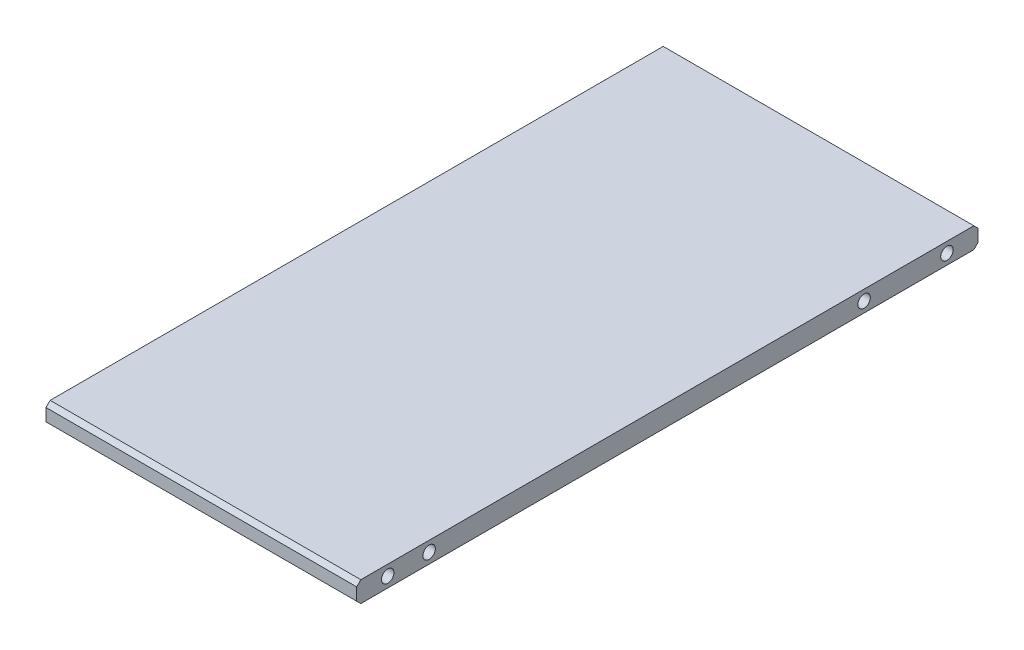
ISO-10303-21;
HEADER;
FILE_DESCRIPTION(('STEP AP214'),'2;1');
FILE_NAME('part.step','',(''),(''),'','','');
FILE_SCHEMA(('AUTOMOTIVE_DESIGN { 1 0 10303 214 1 1 1 1 }'));
ENDSEC;
DATA;
#1=APPLICATION_CONTEXT('core data for automotive mechanical design processes');
#2=APPLICATION_PROTOCOL_DEFINITION('international standard','automotive_design',2000,#1);
#3=PRODUCT_CONTEXT('',#1,'mechanical');
#4=PRODUCT('Part','Part','',(#3));
#5=PRODUCT_RELATED_PRODUCT_CATEGORY('part','',(#4));
#6=PRODUCT_DEFINITION_FORMATION('','',#4);
#7=PRODUCT_DEFINITION_CONTEXT('part definition',#1,'design');
#8=PRODUCT_DEFINITION('design','',#6,#7);
#9=PRODUCT_DEFINITION_SHAPE('','',#8);
#10=(LENGTH_UNIT() NAMED_UNIT(*) SI_UNIT(.MILLI.,.METRE.));
#11=(NAMED_UNIT(*) PLANE_ANGLE_UNIT() SI_UNIT($,.RADIAN.));
#12=(NAMED_UNIT(*) SI_UNIT($,.STERADIAN.) SOLID_ANGLE_UNIT());
#13=UNCERTAINTY_MEASURE_WITH_UNIT(LENGTH_MEASURE(1.E-05),#10,'distance_accuracy_value','');
#14=(GEOMETRIC_REPRESENTATION_CONTEXT(3) GLOBAL_UNCERTAINTY_ASSIGNED_CONTEXT((#13)) GLOBAL_UNIT_ASSIGNED_CONTEXT((#10,
#11,#12)) REPRESENTATION_CONTEXT('',''));
#15=CARTESIAN_POINT('',(0.,0.,0.));
#16=DIRECTION('',(0.,0.,1.));
#17=DIRECTION('',(1.,0.,0.));
#18=AXIS2_PLACEMENT_3D('',#15,#16,#17);
#19=CARTESIAN_POINT('',(-150.,-10.5,0.));
#20=DIRECTION('',(0.,0.,1.));
#21=DIRECTION('',(1.,0.,0.));
#22=AXIS2_PLACEMENT_3D('',#19,#20,#21);
#23=PLANE('',#22);
#24=DIRECTION('',(0.,1.,0.));
#25=VECTOR('',#24,1.);
#26=CARTESIAN_POINT('',(-150.,-10.5,0.));
#27=LINE('',#26,#25);
#28=CARTESIAN_POINT('',(-150.,-8.50000000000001,0.));
#29=VERTEX_POINT('',#28);
#30=CARTESIAN_POINT('',(-150.,-2.50000000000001,0.));
#31=VERTEX_POINT('',#30);
#32=EDGE_CURVE('E102',#29,#31,#27,.T.);
#33=ORIENTED_EDGE('',*,*,#32,.F.);
#34=DIRECTION('',(1.,0.,0.));
#35=VECTOR('',#34,1.);
#36=CARTESIAN_POINT('',(0.,-8.50000000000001,0.));
#37=LINE('',#36,#35);
#38=CARTESIAN_POINT('',(0.,-8.50000000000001,0.));
#39=VERTEX_POINT('',#38);
#40=EDGE_CURVE('E114',#29,#39,#37,.T.);
#41=ORIENTED_EDGE('',*,*,#40,.T.);
#42=DIRECTION('',(0.,1.,0.));
#43=VECTOR('',#42,1.);
#44=CARTESIAN_POINT('',(0.,-10.5,0.));
#45=LINE('',#44,#43);
#46=CARTESIAN_POINT('',(0.,-2.50000000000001,0.));
#47=VERTEX_POINT('',#46);
#48=EDGE_CURVE('E170',#39,#47,#45,.T.);
#49=ORIENTED_EDGE('',*,*,#48,.T.);
#50=DIRECTION('',(-1.,0.,0.));
#51=VECTOR('',#50,1.);
#52=CARTESIAN_POINT('',(-150.,-2.50000000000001,0.));
#53=LINE('',#52,#51);
#54=EDGE_CURVE('E117',#47,#31,#53,.T.);
#55=ORIENTED_EDGE('',*,*,#54,.T.);
#56=EDGE_LOOP('',(#33,#41,#49,#55));
#57=FACE_BOUND('',#56,.T.);
#58=ADVANCED_FACE('F32',(#57),#23,.T.);
#59=CARTESIAN_POINT('',(-150.,-10.5,-300.));
#60=DIRECTION('',(-1.,0.,0.));
#61=DIRECTION('',(0.,0.,1.));
#62=AXIS2_PLACEMENT_3D('',#59,#60,#61);
#63=PLANE('',#62);
#64=CARTESIAN_POINT('',(-150.,-5.50000000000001,-35.));
#65=DIRECTION('',(1.,0.,0.));
#66=DIRECTION('',(0.,0.,-1.));
#67=AXIS2_PLACEMENT_3D('',#64,#65,#66);
#68=CIRCLE('',#67,3.00000000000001);
#69=CARTESIAN_POINT('',(-150.,-5.50000000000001,-38.));
#70=VERTEX_POINT('',#69);
#71=EDGE_CURVE('E187',#70,#70,#68,.T.);
#72=ORIENTED_EDGE('',*,*,#71,.T.);
#73=EDGE_LOOP('',(#72));
#74=FACE_BOUND('',#73,.T.);
#75=CARTESIAN_POINT('',(-150.,-5.50000000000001,-285.));
#76=DIRECTION('',(1.,0.,0.));
#77=DIRECTION('',(0.,0.,-1.));
#78=AXIS2_PLACEMENT_3D('',#75,#76,#77);
#79=CIRCLE('',#78,2.99999999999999);
#80=CARTESIAN_POINT('',(-150.,-5.50000000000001,-288.));
#81=VERTEX_POINT('',#80);
#82=EDGE_CURVE('E181',#81,#81,#79,.T.);
#83=ORIENTED_EDGE('',*,*,#82,.T.);
#84=EDGE_LOOP('',(#83));
#85=FACE_BOUND('',#84,.T.);
#86=CARTESIAN_POINT('',(-150.,-5.50000000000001,-245.));
#87=DIRECTION('',(1.,0.,0.));
#88=DIRECTION('',(0.,0.,-1.));
#89=AXIS2_PLACEMENT_3D('',#86,#87,#88);
#90=CIRCLE('',#89,2.99999999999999);
#91=CARTESIAN_POINT('',(-150.,-5.50000000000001,-248.));
#92=VERTEX_POINT('',#91);
#93=EDGE_CURVE('E176',#92,#92,#90,.T.);
#94=ORIENTED_EDGE('',*,*,#93,.T.);
#95=EDGE_LOOP('',(#94));
#96=FACE_BOUND('',#95,.T.);
#97=CARTESIAN_POINT('',(-150.,-5.50000000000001,-15.));
#98=DIRECTION('',(1.,0.,0.));
#99=DIRECTION('',(0.,0.,-1.));
#100=AXIS2_PLACEMENT_3D('',#97,#98,#99);
#101=CIRCLE('',#100,3.00000000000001);
#102=CARTESIAN_POINT('',(-150.,-5.50000000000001,-18.));
#103=VERTEX_POINT('',#102);
#104=EDGE_CURVE('E158',#103,#103,#101,.T.);
#105=ORIENTED_EDGE('',*,*,#104,.T.);
#106=EDGE_LOOP('',(#105));
#107=FACE_BOUND('',#106,.T.);
#108=DIRECTION('',(0.,0.,1.));
#109=VECTOR('',#108,1.);
#110=CARTESIAN_POINT('',(-150.,-10.5,-300.));
#111=LINE('',#110,#109);
#112=CARTESIAN_POINT('',(-150.,-10.5,-298.));
#113=VERTEX_POINT('',#112);
#114=CARTESIAN_POINT('',(-150.,-10.5,-2.));
#115=VERTEX_POINT('',#114);
#116=EDGE_CURVE('E105',#113,#115,#111,.T.);
#117=ORIENTED_EDGE('',*,*,#116,.T.);
#118=DIRECTION('',(0.,0.707106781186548,0.707106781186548));
#119=VECTOR('',#118,1.);
#120=CARTESIAN_POINT('',(-150.,-159.5,-151.));
#121=LINE('',#120,#119);
#122=EDGE_CURVE('E99',#115,#29,#121,.T.);
#123=ORIENTED_EDGE('',*,*,#122,.T.);
#124=ORIENTED_EDGE('',*,*,#32,.T.);
#125=DIRECTION('',(0.,-0.707106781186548,0.707106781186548));
#126=VECTOR('',#125,1.);
#127=CARTESIAN_POINT('',(-150.,143.5,-146.));
#128=LINE('',#127,#126);
#129=CARTESIAN_POINT('',(-150.,-0.500000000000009,-2.));
#130=VERTEX_POINT('',#129);
#131=EDGE_CURVE('E137',#31,#130,#128,.F.);
#132=ORIENTED_EDGE('',*,*,#131,.T.);
#133=DIRECTION('',(0.,0.,1.));
#134=VECTOR('',#133,1.);
#135=CARTESIAN_POINT('',(-150.,-0.500000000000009,-300.));
#136=LINE('',#135,#134);
#137=CARTESIAN_POINT('',(-150.,-0.500000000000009,-298.));
#138=VERTEX_POINT('',#137);
#139=EDGE_CURVE('E152',#138,#130,#136,.T.);
#140=ORIENTED_EDGE('',*,*,#139,.F.);
#141=DIRECTION('',(0.,0.707106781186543,0.707106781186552));
#142=VECTOR('',#141,1.);
#143=CARTESIAN_POINT('',(-150.,-6.49999999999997,-304.));
#144=LINE('',#143,#142);
#145=CARTESIAN_POINT('',(-150.,-2.50000000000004,-300.));
#146=VERTEX_POINT('',#145);
#147=EDGE_CURVE('E47',#138,#146,#144,.F.);
#148=ORIENTED_EDGE('',*,*,#147,.T.);
#149=DIRECTION('',(0.,1.,0.));
#150=VECTOR('',#149,1.);
#151=CARTESIAN_POINT('',(-150.,-10.5,-300.));
#152=LINE('',#151,#150);
#153=CARTESIAN_POINT('',(-150.,-8.50000000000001,-300.));
#154=VERTEX_POINT('',#153);
#155=EDGE_CURVE('E118',#154,#146,#152,.T.);
#156=ORIENTED_EDGE('',*,*,#155,.F.);
#157=DIRECTION('',(0.,-0.707106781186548,0.707106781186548));
#158=VECTOR('',#157,1.);
#159=CARTESIAN_POINT('',(-150.,-9.50000000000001,-299.));
#160=LINE('',#159,#158);
#161=EDGE_CURVE('E55',#154,#113,#160,.T.);
#162=ORIENTED_EDGE('',*,*,#161,.T.);
#163=EDGE_LOOP('',(#117,#123,#124,#132,#140,#148,#156,#162));
#164=FACE_BOUND('',#163,.T.);
#165=ADVANCED_FACE('F101',(#74,#85,#96,#107,#164),#63,.T.);
#166=CARTESIAN_POINT('',(0.,-10.5,-300.));
#167=DIRECTION('',(0.,0.,-1.));
#168=DIRECTION('',(-1.,0.,0.));
#169=AXIS2_PLACEMENT_3D('',#166,#167,#168);
#170=PLANE('',#169);
#171=DIRECTION('',(0.,1.,0.));
#172=VECTOR('',#171,1.);
#173=CARTESIAN_POINT('',(0.,-10.5,-300.));
#174=LINE('',#173,#172);
#175=CARTESIAN_POINT('',(0.,-8.50000000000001,-300.));
#176=VERTEX_POINT('',#175);
#177=CARTESIAN_POINT('',(0.,-2.50000000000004,-300.));
#178=VERTEX_POINT('',#177);
#179=EDGE_CURVE('E169',#176,#178,#174,.T.);
#180=ORIENTED_EDGE('',*,*,#179,.F.);
#181=DIRECTION('',(-1.,0.,0.));
#182=VECTOR('',#181,1.);
#183=CARTESIAN_POINT('',(-150.,-8.50000000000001,-300.));
#184=LINE('',#183,#182);
#185=EDGE_CURVE('E142',#176,#154,#184,.T.);
#186=ORIENTED_EDGE('',*,*,#185,.T.);
#187=ORIENTED_EDGE('',*,*,#155,.T.);
#188=DIRECTION('',(1.,0.,0.));
#189=VECTOR('',#188,1.);
#190=CARTESIAN_POINT('',(0.,-2.50000000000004,-300.));
#191=LINE('',#190,#189);
#192=EDGE_CURVE('E109',#146,#178,#191,.T.);
#193=ORIENTED_EDGE('',*,*,#192,.T.);
#194=EDGE_LOOP('',(#180,#186,#187,#193));
#195=FACE_BOUND('',#194,.T.);
#196=ADVANCED_FACE('F209',(#195),#170,.T.);
#197=CARTESIAN_POINT('',(0.,-10.5,0.));
#198=DIRECTION('',(1.,0.,0.));
#199=DIRECTION('',(0.,0.,-1.));
#200=AXIS2_PLACEMENT_3D('',#197,#198,#199);
#201=PLANE('',#200);
#202=CARTESIAN_POINT('',(0.,-5.50000000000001,-35.));
#203=DIRECTION('',(1.,0.,0.));
#204=DIRECTION('',(0.,0.,-1.));
#205=AXIS2_PLACEMENT_3D('',#202,#203,#204);
#206=CIRCLE('',#205,3.00000000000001);
#207=CARTESIAN_POINT('',(0.,-5.50000000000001,-38.));
#208=VERTEX_POINT('',#207);
#209=EDGE_CURVE('E184',#208,#208,#206,.T.);
#210=ORIENTED_EDGE('',*,*,#209,.F.);
#211=EDGE_LOOP('',(#210));
#212=FACE_BOUND('',#211,.T.);
#213=CARTESIAN_POINT('',(0.,-5.50000000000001,-285.));
#214=DIRECTION('',(1.,0.,0.));
#215=DIRECTION('',(0.,0.,-1.));
#216=AXIS2_PLACEMENT_3D('',#213,#214,#215);
#217=CIRCLE('',#216,2.99999999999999);
#218=CARTESIAN_POINT('',(0.,-5.50000000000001,-288.));
#219=VERTEX_POINT('',#218);
#220=EDGE_CURVE('E190',#219,#219,#217,.T.);
#221=ORIENTED_EDGE('',*,*,#220,.F.);
#222=EDGE_LOOP('',(#221));
#223=FACE_BOUND('',#222,.T.);
#224=CARTESIAN_POINT('',(0.,-5.50000000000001,-245.));
#225=DIRECTION('',(1.,0.,0.));
#226=DIRECTION('',(0.,0.,-1.));
#227=AXIS2_PLACEMENT_3D('',#224,#225,#226);
#228=CIRCLE('',#227,2.99999999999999);
#229=CARTESIAN_POINT('',(0.,-5.50000000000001,-248.));
#230=VERTEX_POINT('',#229);
#231=EDGE_CURVE('E178',#230,#230,#228,.T.);
#232=ORIENTED_EDGE('',*,*,#231,.F.);
#233=EDGE_LOOP('',(#232));
#234=FACE_BOUND('',#233,.T.);
#235=CARTESIAN_POINT('',(0.,-5.50000000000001,-15.));
#236=DIRECTION('',(1.,0.,0.));
#237=DIRECTION('',(0.,0.,-1.));
#238=AXIS2_PLACEMENT_3D('',#235,#236,#237);
#239=CIRCLE('',#238,3.00000000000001);
#240=CARTESIAN_POINT('',(0.,-5.50000000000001,-18.));
#241=VERTEX_POINT('',#240);
#242=EDGE_CURVE('E163',#241,#241,#239,.T.);
#243=ORIENTED_EDGE('',*,*,#242,.F.);
#244=EDGE_LOOP('',(#243));
#245=FACE_BOUND('',#244,.T.);
#246=ORIENTED_EDGE('',*,*,#48,.F.);
#247=DIRECTION('',(0.,-0.707106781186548,-0.707106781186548));
#248=VECTOR('',#247,1.);
#249=CARTESIAN_POINT('',(0.,-9.50000000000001,-1.));
#250=LINE('',#249,#248);
#251=CARTESIAN_POINT('',(0.,-10.5,-2.));
#252=VERTEX_POINT('',#251);
#253=EDGE_CURVE('E121',#39,#252,#250,.T.);
#254=ORIENTED_EDGE('',*,*,#253,.T.);
#255=DIRECTION('',(0.,0.,-1.));
#256=VECTOR('',#255,1.);
#257=CARTESIAN_POINT('',(0.,-10.5,0.));
#258=LINE('',#257,#256);
#259=CARTESIAN_POINT('',(0.,-10.5,-298.));
#260=VERTEX_POINT('',#259);
#261=EDGE_CURVE('E160',#252,#260,#258,.T.);
#262=ORIENTED_EDGE('',*,*,#261,.T.);
#263=DIRECTION('',(0.,0.707106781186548,-0.707106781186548));
#264=VECTOR('',#263,1.);
#265=CARTESIAN_POINT('',(0.,-159.5,-149.));
#266=LINE('',#265,#264);
#267=EDGE_CURVE('E130',#260,#176,#266,.T.);
#268=ORIENTED_EDGE('',*,*,#267,.T.);
#269=ORIENTED_EDGE('',*,*,#179,.T.);
#270=DIRECTION('',(0.,-0.707106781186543,-0.707106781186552));
#271=VECTOR('',#270,1.);
#272=CARTESIAN_POINT('',(0.,143.5,-153.999999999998));
#273=LINE('',#272,#271);
#274=CARTESIAN_POINT('',(0.,-0.500000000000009,-298.));
#275=VERTEX_POINT('',#274);
#276=EDGE_CURVE('E124',#178,#275,#273,.F.);
#277=ORIENTED_EDGE('',*,*,#276,.T.);
#278=DIRECTION('',(0.,0.,-1.));
#279=VECTOR('',#278,1.);
#280=CARTESIAN_POINT('',(0.,-0.500000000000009,0.));
#281=LINE('',#280,#279);
#282=CARTESIAN_POINT('',(0.,-0.500000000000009,-2.));
#283=VERTEX_POINT('',#282);
#284=EDGE_CURVE('E150',#283,#275,#281,.T.);
#285=ORIENTED_EDGE('',*,*,#284,.F.);
#286=DIRECTION('',(0.,0.707106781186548,-0.707106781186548));
#287=VECTOR('',#286,1.);
#288=CARTESIAN_POINT('',(0.,-6.50000000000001,4.));
#289=LINE('',#288,#287);
#290=EDGE_CURVE('E122',#283,#47,#289,.F.);
#291=ORIENTED_EDGE('',*,*,#290,.T.);
#292=EDGE_LOOP('',(#246,#254,#262,#268,#269,#277,#285,#291));
#293=FACE_BOUND('',#292,.T.);
#294=ADVANCED_FACE('F155',(#212,#223,#234,#245,#293),#201,.T.);
#295=CARTESIAN_POINT('',(0.,-10.5,0.));
#296=DIRECTION('',(0.,1.,0.));
#297=DIRECTION('',(0.,0.,1.));
#298=AXIS2_PLACEMENT_3D('',#295,#296,#297);
#299=PLANE('',#298);
#300=ORIENTED_EDGE('',*,*,#261,.F.);
#301=DIRECTION('',(-1.,0.,0.));
#302=VECTOR('',#301,1.);
#303=CARTESIAN_POINT('',(-150.,-10.5,-2.));
#304=LINE('',#303,#302);
#305=EDGE_CURVE('E135',#252,#115,#304,.T.);
#306=ORIENTED_EDGE('',*,*,#305,.T.);
#307=ORIENTED_EDGE('',*,*,#116,.F.);
#308=DIRECTION('',(1.,0.,0.));
#309=VECTOR('',#308,1.);
#310=CARTESIAN_POINT('',(0.,-10.5,-298.));
#311=LINE('',#310,#309);
#312=EDGE_CURVE('E133',#113,#260,#311,.T.);
#313=ORIENTED_EDGE('',*,*,#312,.T.);
#314=EDGE_LOOP('',(#300,#306,#307,#313));
#315=FACE_BOUND('',#314,.T.);
#316=ADVANCED_FACE('F208',(#315),#299,.F.);
#317=CARTESIAN_POINT('',(0.,-0.500000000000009,0.));
#318=DIRECTION('',(0.,1.,0.));
#319=DIRECTION('',(0.,0.,1.));
#320=AXIS2_PLACEMENT_3D('',#317,#318,#319);
#321=PLANE('',#320);
#322=ORIENTED_EDGE('',*,*,#284,.T.);
#323=DIRECTION('',(-1.,0.,0.));
#324=VECTOR('',#323,1.);
#325=CARTESIAN_POINT('',(0.,-0.500000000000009,-298.));
#326=LINE('',#325,#324);
#327=EDGE_CURVE('E11',#275,#138,#326,.T.);
#328=ORIENTED_EDGE('',*,*,#327,.T.);
#329=ORIENTED_EDGE('',*,*,#139,.T.);
#330=DIRECTION('',(1.,0.,0.));
#331=VECTOR('',#330,1.);
#332=CARTESIAN_POINT('',(0.,-0.500000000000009,-2.));
#333=LINE('',#332,#331);
#334=EDGE_CURVE('E40',#130,#283,#333,.T.);
#335=ORIENTED_EDGE('',*,*,#334,.T.);
#336=EDGE_LOOP('',(#322,#328,#329,#335));
#337=FACE_BOUND('',#336,.T.);
#338=ADVANCED_FACE('F149',(#337),#321,.T.);
#339=CARTESIAN_POINT('',(-150.,-8.50000000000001,0.));
#340=DIRECTION('',(0.,-0.707106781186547,0.707106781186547));
#341=DIRECTION('',(-1.,0.,0.));
#342=AXIS2_PLACEMENT_3D('',#339,#340,#341);
#343=PLANE('',#342);
#344=ORIENTED_EDGE('',*,*,#122,.F.);
#345=ORIENTED_EDGE('',*,*,#305,.F.);
#346=ORIENTED_EDGE('',*,*,#253,.F.);
#347=ORIENTED_EDGE('',*,*,#40,.F.);
#348=EDGE_LOOP('',(#344,#345,#346,#347));
#349=FACE_BOUND('',#348,.T.);
#350=ADVANCED_FACE('F120',(#349),#343,.T.);
#351=CARTESIAN_POINT('',(0.,-8.50000000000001,-300.));
#352=DIRECTION('',(0.,-0.707106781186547,-0.707106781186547));
#353=DIRECTION('',(1.,0.,0.));
#354=AXIS2_PLACEMENT_3D('',#351,#352,#353);
#355=PLANE('',#354);
#356=ORIENTED_EDGE('',*,*,#267,.F.);
#357=ORIENTED_EDGE('',*,*,#312,.F.);
#358=ORIENTED_EDGE('',*,*,#161,.F.);
#359=ORIENTED_EDGE('',*,*,#185,.F.);
#360=EDGE_LOOP('',(#356,#357,#358,#359));
#361=FACE_BOUND('',#360,.T.);
#362=ADVANCED_FACE('F240',(#361),#355,.T.);
#363=CARTESIAN_POINT('',(0.,-0.500000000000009,-298.));
#364=DIRECTION('',(0.,-0.707106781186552,0.707106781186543));
#365=DIRECTION('',(-1.,0.,0.));
#366=AXIS2_PLACEMENT_3D('',#363,#364,#365);
#367=PLANE('',#366);
#368=ORIENTED_EDGE('',*,*,#276,.F.);
#369=ORIENTED_EDGE('',*,*,#192,.F.);
#370=ORIENTED_EDGE('',*,*,#147,.F.);
#371=ORIENTED_EDGE('',*,*,#327,.F.);
#372=EDGE_LOOP('',(#368,#369,#370,#371));
#373=FACE_BOUND('',#372,.T.);
#374=ADVANCED_FACE('F226',(#373),#367,.F.);
#375=CARTESIAN_POINT('',(0.,-0.500000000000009,-2.));
#376=DIRECTION('',(0.,-0.707106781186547,-0.707106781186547));
#377=DIRECTION('',(1.,0.,0.));
#378=AXIS2_PLACEMENT_3D('',#375,#376,#377);
#379=PLANE('',#378);
#380=ORIENTED_EDGE('',*,*,#131,.F.);
#381=ORIENTED_EDGE('',*,*,#54,.F.);
#382=ORIENTED_EDGE('',*,*,#290,.F.);
#383=ORIENTED_EDGE('',*,*,#334,.F.);
#384=EDGE_LOOP('',(#380,#381,#382,#383));
#385=FACE_BOUND('',#384,.T.);
#386=ADVANCED_FACE('F34',(#385),#379,.F.);
#387=CARTESIAN_POINT('',(-150.,-5.50000000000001,-15.));
#388=DIRECTION('',(1.,0.,0.));
#389=DIRECTION('',(0.,0.,-1.));
#390=AXIS2_PLACEMENT_3D('',#387,#388,#389);
#391=CYLINDRICAL_SURFACE('',#390,3.00000000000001);
#392=ORIENTED_EDGE('',*,*,#104,.F.);
#393=EDGE_LOOP('',(#392));
#394=FACE_BOUND('',#393,.T.);
#395=ORIENTED_EDGE('',*,*,#242,.T.);
#396=EDGE_LOOP('',(#395));
#397=FACE_BOUND('',#396,.T.);
#398=ADVANCED_FACE('F216',(#394,#397),#391,.F.);
#399=CARTESIAN_POINT('',(-150.,-5.50000000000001,-245.));
#400=DIRECTION('',(1.,0.,0.));
#401=DIRECTION('',(0.,0.,-1.));
#402=AXIS2_PLACEMENT_3D('',#399,#400,#401);
#403=CYLINDRICAL_SURFACE('',#402,2.99999999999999);
#404=ORIENTED_EDGE('',*,*,#93,.F.);
#405=EDGE_LOOP('',(#404));
#406=FACE_BOUND('',#405,.T.);
#407=ORIENTED_EDGE('',*,*,#231,.T.);
#408=EDGE_LOOP('',(#407));
#409=FACE_BOUND('',#408,.T.);
#410=ADVANCED_FACE('F202',(#406,#409),#403,.F.);
#411=CARTESIAN_POINT('',(-150.,-5.50000000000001,-285.));
#412=DIRECTION('',(1.,0.,0.));
#413=DIRECTION('',(0.,0.,-1.));
#414=AXIS2_PLACEMENT_3D('',#411,#412,#413);
#415=CYLINDRICAL_SURFACE('',#414,2.99999999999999);
#416=ORIENTED_EDGE('',*,*,#82,.F.);
#417=EDGE_LOOP('',(#416));
#418=FACE_BOUND('',#417,.T.);
#419=ORIENTED_EDGE('',*,*,#220,.T.);
#420=EDGE_LOOP('',(#419));
#421=FACE_BOUND('',#420,.T.);
#422=ADVANCED_FACE('F198',(#418,#421),#415,.F.);
#423=CARTESIAN_POINT('',(-150.,-5.50000000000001,-35.));
#424=DIRECTION('',(1.,0.,0.));
#425=DIRECTION('',(0.,0.,-1.));
#426=AXIS2_PLACEMENT_3D('',#423,#424,#425);
#427=CYLINDRICAL_SURFACE('',#426,3.00000000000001);
#428=ORIENTED_EDGE('',*,*,#71,.F.);
#429=EDGE_LOOP('',(#428));
#430=FACE_BOUND('',#429,.T.);
#431=ORIENTED_EDGE('',*,*,#209,.T.);
#432=EDGE_LOOP('',(#431));
#433=FACE_BOUND('',#432,.T.);
#434=ADVANCED_FACE('F201',(#430,#433),#427,.F.);
#435=CLOSED_SHELL('',(#58,#165,#196,#294,#316,#338,#350,#362,#374,#386,#398,#410,#422,#434));
#436=MANIFOLD_SOLID_BREP('B2',#435);
#437=ADVANCED_BREP_SHAPE_REPRESENTATION('',(#18,#436),#14);
#438=SHAPE_DEFINITION_REPRESENTATION(#9,#437);
ENDSEC;
END-ISO-10303-21;
